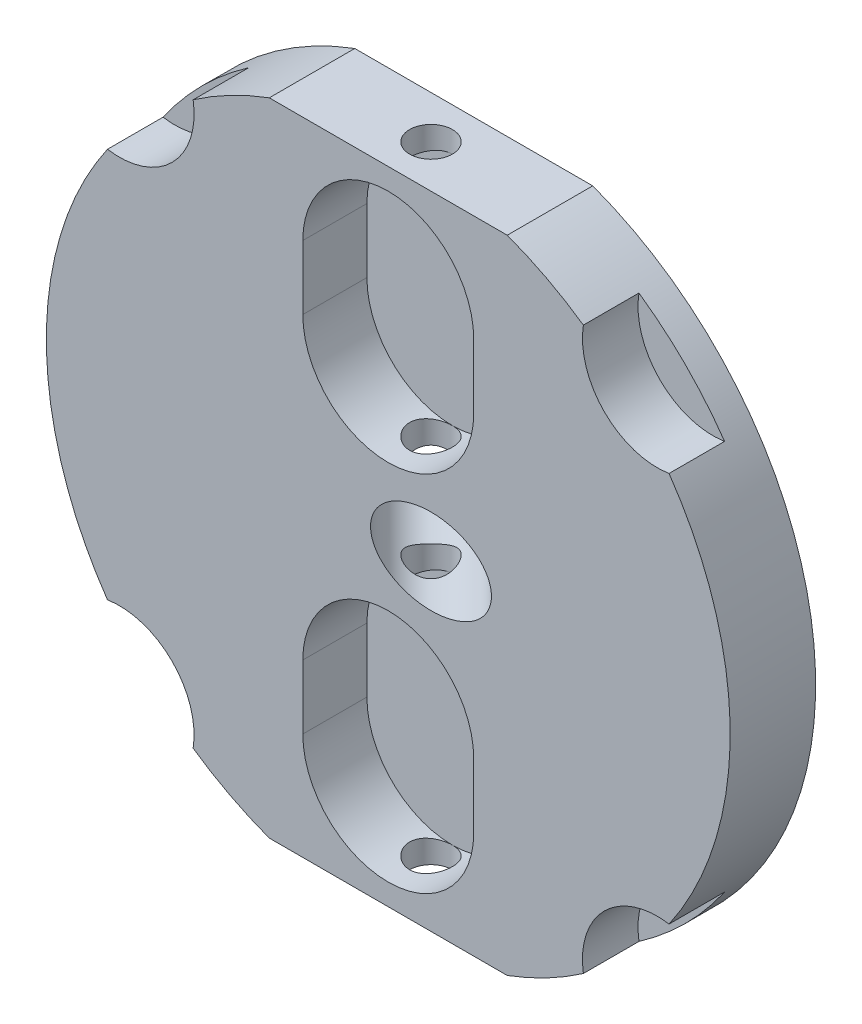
from build123d import *

# Parameters (mm, degrees)
ESQUISSE1_W                  = 2
ESQUISSE1_H                  = 8
ENL_V_MAT_EXTRU_1_DEPTH      = 12.357816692
ENL_V_MAT_EXTRU_1_DEPTH_BACK = 12.357816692
ESQUISSE2_R                  = 0.5
ESQUISSE3_OUTSIDE_W          = 22.544
ESQUISSE3_OUTSIDE_H          = 22.544
ESQUISSE3_OUTSIDE_W_2        = 26.126522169
ESQUISSE3_OUTSIDE_H_2        = 15
ENL_V_MAT_EXTRU_2_DEPTH      = 5
ENL_V_MAT_EXTRU_4_DEPTH      = 1.5
ESQUISSE7_R                  = 1.75
ENL_V_MAT_EXTRU_5_DEPTH      = 1.3
R_P_TITION_CIRCULAIRE1_COUNT = 4


with BuildPart() as part:
    # Esquisse1 → R_volution1 (revolve)
    with BuildSketch(Plane(origin=(0, 0, 0), x_dir=(0, 0, -1), z_dir=(1, 0, 0)), mode=Mode.PRIVATE) as r_volution1_sk:
        with Locations((0, 4)):
            Rectangle(ESQUISSE1_W, ESQUISSE1_H)
    revolve(r_volution1_sk.sketch.rotate(Axis((0, 0, 0), (0, 0, -1)), 90), axis=Axis((0, 0, 0), (0, 0, -1)))

    # Esquisse2 → Enl_v. mat.-Extru.1 (cut, two sides: drawn at the far end of the back side and taken through both)
    with BuildSketch(Plane(origin=(0, 0, 0), x_dir=(1, 0, 0), z_dir=(0, 1, 0)).offset(-ENL_V_MAT_EXTRU_1_DEPTH_BACK)):
        with Locations(Location((0, 0, 0), (0, 0, 270))):
            Circle(ESQUISSE2_R)
    extrude(amount=ENL_V_MAT_EXTRU_1_DEPTH + ENL_V_MAT_EXTRU_1_DEPTH_BACK, mode=Mode.SUBTRACT)

    # Esquisse3 outside → Enl_v. mat.-Extru.2 (cut, symmetric)
    with BuildSketch(Plane.XY):
        Rectangle(ESQUISSE3_OUTSIDE_W, ESQUISSE3_OUTSIDE_H)
        with Locations((-1.777683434, 0)):
            Rectangle(ESQUISSE3_OUTSIDE_W_2, ESQUISSE3_OUTSIDE_H_2, mode=Mode.SUBTRACT)
    extrude(amount=ENL_V_MAT_EXTRU_2_DEPTH, both=True, mode=Mode.SUBTRACT)

    # Esquisse4 → Enl_vement de mati_re-R_volution1 (revolve, cut)
    with BuildSketch(Plane(origin=(0, 0, 0), x_dir=(1, 0, 0), z_dir=(0, 1, 0)), mode=Mode.PRIVATE) as enl_vement_de_mati_re_r_volution1_sk:
        Polygon((-2.647882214, 2.647882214), (3.154712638, -3.154712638), (3.861819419, -2.447605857), (-1.940775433, 3.354988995), align=None)
    revolve(enl_vement_de_mati_re_r_volution1_sk.sketch.rotate(Axis((-4.318675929, 0, -4.318675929), (0.7071067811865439, 0, 0.7071067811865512)), 180), axis=Axis((-4.318675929, 0, -4.318675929), (0.7071067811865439, 0, 0.7071067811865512)), mode=Mode.SUBTRACT)

    # Esquisse6 → Enl_v. mat.-Extru.4 (cut)
    with BuildSketch(Plane.XY.offset(1)):
        with BuildLine():
            Line((2, 5), (2, 3.5))
            ThreePointArc((2, 3.5), (0, 1.5), (-2, 3.5))
            Line((-2, 3.5), (-2, 5))
            ThreePointArc((-2, 5), (0, 7), (2, 5))
        make_face()
    enl_v_mat_extru_4 = extrude(amount=-ENL_V_MAT_EXTRU_4_DEPTH, mode=Mode.SUBTRACT)

    # Sym_trie1: Enl_v. mat.-Extru.4 across plane
    add(enl_v_mat_extru_4.mirror(Plane.ZX), mode=Mode.SUBTRACT)

    # Esquisse7 → Enl_v. mat.-Extru.5 (cut)
    with BuildSketch(Plane.XY.offset(1)):
        with Locations((-6.293250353, 6.293250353)):
            Circle(ESQUISSE7_R)
    enl_v_mat_extru_5 = extrude(amount=-ENL_V_MAT_EXTRU_5_DEPTH, mode=Mode.SUBTRACT)

    # R_p_tition circulaire1: Enl_v. mat.-Extru.5 ×4 about axis
    r_p_tition_circulaire1_axis = Axis((0, 0, 0), (0, 0, 1))
    for i in range(1, R_P_TITION_CIRCULAIRE1_COUNT):
        add(enl_v_mat_extru_5.rotate(r_p_tition_circulaire1_axis, i * 360 / R_P_TITION_CIRCULAIRE1_COUNT), mode=Mode.SUBTRACT)


solid = part.part
